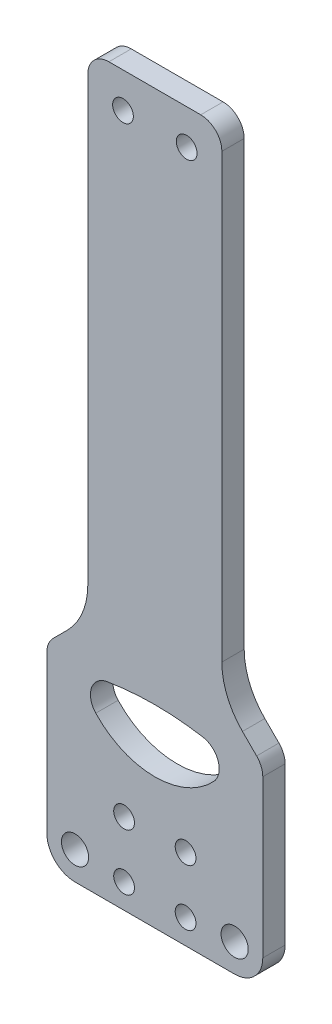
ISO-10303-21;
HEADER;
FILE_DESCRIPTION(('STEP AP214'),'2;1');
FILE_NAME('part.step','',(''),(''),'','','');
FILE_SCHEMA(('AUTOMOTIVE_DESIGN { 1 0 10303 214 1 1 1 1 }'));
ENDSEC;
DATA;
#1=APPLICATION_CONTEXT('core data for automotive mechanical design processes');
#2=APPLICATION_PROTOCOL_DEFINITION('international standard','automotive_design',2000,#1);
#3=PRODUCT_CONTEXT('',#1,'mechanical');
#4=PRODUCT('Part','Part','',(#3));
#5=PRODUCT_RELATED_PRODUCT_CATEGORY('part','',(#4));
#6=PRODUCT_DEFINITION_FORMATION('','',#4);
#7=PRODUCT_DEFINITION_CONTEXT('part definition',#1,'design');
#8=PRODUCT_DEFINITION('design','',#6,#7);
#9=PRODUCT_DEFINITION_SHAPE('','',#8);
#10=(LENGTH_UNIT() NAMED_UNIT(*) SI_UNIT(.MILLI.,.METRE.));
#11=(NAMED_UNIT(*) PLANE_ANGLE_UNIT() SI_UNIT($,.RADIAN.));
#12=(NAMED_UNIT(*) SI_UNIT($,.STERADIAN.) SOLID_ANGLE_UNIT());
#13=UNCERTAINTY_MEASURE_WITH_UNIT(LENGTH_MEASURE(1.E-05),#10,'distance_accuracy_value','');
#14=(GEOMETRIC_REPRESENTATION_CONTEXT(3) GLOBAL_UNCERTAINTY_ASSIGNED_CONTEXT((#13)) GLOBAL_UNIT_ASSIGNED_CONTEXT((#10,
#11,#12)) REPRESENTATION_CONTEXT('',''));
#15=CARTESIAN_POINT('',(0.,0.,0.));
#16=DIRECTION('',(0.,0.,1.));
#17=DIRECTION('',(1.,0.,0.));
#18=AXIS2_PLACEMENT_3D('',#15,#16,#17);
#19=CARTESIAN_POINT('',(0.,0.,3.175));
#20=DIRECTION('',(0.,0.,1.));
#21=DIRECTION('',(1.,0.,0.));
#22=AXIS2_PLACEMENT_3D('',#19,#20,#21);
#23=PLANE('',#22);
#24=CARTESIAN_POINT('',(-4.52500000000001,111.858882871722,3.175));
#25=DIRECTION('',(0.,0.,1.));
#26=DIRECTION('',(1.,0.,0.));
#27=AXIS2_PLACEMENT_3D('',#24,#25,#26);
#28=CIRCLE('',#27,1.4732);
#29=CARTESIAN_POINT('',(-3.0518,111.858882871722,3.175));
#30=VERTEX_POINT('',#29);
#31=EDGE_CURVE('E692',#30,#30,#28,.T.);
#32=ORIENTED_EDGE('',*,*,#31,.F.);
#33=EDGE_LOOP('',(#32));
#34=FACE_BOUND('',#33,.T.);
#35=CARTESIAN_POINT('',(-4.36880000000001,17.,3.175));
#36=DIRECTION('',(0.,0.,1.));
#37=DIRECTION('',(1.,0.,0.));
#38=AXIS2_PLACEMENT_3D('',#35,#36,#37);
#39=CIRCLE('',#38,1.4732);
#40=CARTESIAN_POINT('',(-2.89560000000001,17.,3.175));
#41=VERTEX_POINT('',#40);
#42=EDGE_CURVE('E700',#41,#41,#39,.T.);
#43=ORIENTED_EDGE('',*,*,#42,.F.);
#44=EDGE_LOOP('',(#43));
#45=FACE_BOUND('',#44,.T.);
#46=CARTESIAN_POINT('',(4.36880000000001,25.,3.175));
#47=DIRECTION('',(0.,0.,1.));
#48=DIRECTION('',(1.,0.,0.));
#49=AXIS2_PLACEMENT_3D('',#46,#47,#48);
#50=CIRCLE('',#49,1.4732);
#51=CARTESIAN_POINT('',(5.84200000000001,25.,3.175));
#52=VERTEX_POINT('',#51);
#53=EDGE_CURVE('E708',#52,#52,#50,.T.);
#54=ORIENTED_EDGE('',*,*,#53,.F.);
#55=EDGE_LOOP('',(#54));
#56=FACE_BOUND('',#55,.T.);
#57=CARTESIAN_POINT('',(11.34314575,17.5,3.175));
#58=DIRECTION('',(0.,0.,1.));
#59=DIRECTION('',(-1.,0.,0.));
#60=AXIS2_PLACEMENT_3D('',#57,#58,#59);
#61=CIRCLE('',#60,1.9304);
#62=CARTESIAN_POINT('',(9.41274575,17.5,3.175));
#63=VERTEX_POINT('',#62);
#64=EDGE_CURVE('E211',#63,#63,#61,.T.);
#65=ORIENTED_EDGE('',*,*,#64,.F.);
#66=EDGE_LOOP('',(#65));
#67=FACE_BOUND('',#66,.T.);
#68=DIRECTION('',(0.,-1.,0.));
#69=VECTOR('',#68,1.);
#70=CARTESIAN_POINT('',(-15.34314575,13.5000000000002,3.175));
#71=LINE('',#70,#69);
#72=CARTESIAN_POINT('',(-15.34314575,39.7980964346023,3.175));
#73=VERTEX_POINT('',#72);
#74=CARTESIAN_POINT('',(-15.34314575,17.5000000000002,3.175));
#75=VERTEX_POINT('',#74);
#76=EDGE_CURVE('E238',#73,#75,#71,.T.);
#77=ORIENTED_EDGE('',*,*,#76,.T.);
#78=CARTESIAN_POINT('',(-11.34314575,17.5000000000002,3.175));
#79=DIRECTION('',(0.,0.,1.));
#80=DIRECTION('',(1.,0.,0.));
#81=AXIS2_PLACEMENT_3D('',#78,#79,#80);
#82=CIRCLE('',#81,4.);
#83=CARTESIAN_POINT('',(-11.34314575,13.5000000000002,3.175));
#84=VERTEX_POINT('',#83);
#85=EDGE_CURVE('E45',#75,#84,#82,.T.);
#86=ORIENTED_EDGE('',*,*,#85,.T.);
#87=DIRECTION('',(1.,0.,0.));
#88=VECTOR('',#87,1.);
#89=CARTESIAN_POINT('',(-15.34314575,13.5000000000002,3.175));
#90=LINE('',#89,#88);
#91=CARTESIAN_POINT('',(11.34314575,13.5000000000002,3.175));
#92=VERTEX_POINT('',#91);
#93=EDGE_CURVE('E240',#84,#92,#90,.T.);
#94=ORIENTED_EDGE('',*,*,#93,.T.);
#95=CARTESIAN_POINT('',(11.34314575,17.5000000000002,3.175));
#96=DIRECTION('',(0.,0.,1.));
#97=DIRECTION('',(1.,0.,0.));
#98=AXIS2_PLACEMENT_3D('',#95,#96,#97);
#99=CIRCLE('',#98,4.);
#100=CARTESIAN_POINT('',(15.34314575,17.5000000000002,3.175));
#101=VERTEX_POINT('',#100);
#102=EDGE_CURVE('E52',#92,#101,#99,.T.);
#103=ORIENTED_EDGE('',*,*,#102,.T.);
#104=DIRECTION('',(0.,1.,0.));
#105=VECTOR('',#104,1.);
#106=CARTESIAN_POINT('',(15.34314575,13.5000000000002,3.175));
#107=LINE('',#106,#105);
#108=CARTESIAN_POINT('',(15.34314575,39.7980964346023,3.175));
#109=VERTEX_POINT('',#108);
#110=EDGE_CURVE('E222',#101,#109,#107,.T.);
#111=ORIENTED_EDGE('',*,*,#110,.T.);
#112=CARTESIAN_POINT('',(12.34314575,39.7980964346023,3.175));
#113=DIRECTION('',(0.,0.,1.));
#114=DIRECTION('',(1.,0.,0.));
#115=AXIS2_PLACEMENT_3D('',#112,#113,#114);
#116=CIRCLE('',#115,3.);
#117=CARTESIAN_POINT('',(14.4644660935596,41.919416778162,3.175));
#118=VERTEX_POINT('',#117);
#119=EDGE_CURVE('E281',#109,#118,#116,.T.);
#120=ORIENTED_EDGE('',*,*,#119,.T.);
#121=DIRECTION('',(-0.707106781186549,0.707106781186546,0.));
#122=VECTOR('',#121,1.);
#123=CARTESIAN_POINT('',(15.34314575,41.0407371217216,3.175));
#124=LINE('',#123,#122);
#125=CARTESIAN_POINT('',(12.4539321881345,43.929950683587,3.175));
#126=VERTEX_POINT('',#125);
#127=EDGE_CURVE('E224',#118,#126,#124,.T.);
#128=ORIENTED_EDGE('',*,*,#127,.T.);
#129=CARTESIAN_POINT('',(19.525,51.0010184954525,3.175));
#130=DIRECTION('',(0.,0.,1.));
#131=DIRECTION('',(1.,0.,0.));
#132=AXIS2_PLACEMENT_3D('',#129,#130,#131);
#133=CIRCLE('',#132,10.);
#134=CARTESIAN_POINT('',(9.525,51.0010184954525,3.175));
#135=VERTEX_POINT('',#134);
#136=EDGE_CURVE('E314',#126,#135,#133,.F.);
#137=ORIENTED_EDGE('',*,*,#136,.T.);
#138=DIRECTION('',(0.,1.,0.));
#139=VECTOR('',#138,1.);
#140=CARTESIAN_POINT('',(9.525,46.8588828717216,3.175));
#141=LINE('',#140,#139);
#142=CARTESIAN_POINT('',(9.525,113.858882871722,3.175));
#143=VERTEX_POINT('',#142);
#144=EDGE_CURVE('E228',#135,#143,#141,.T.);
#145=ORIENTED_EDGE('',*,*,#144,.T.);
#146=CARTESIAN_POINT('',(6.525,113.858882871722,3.175));
#147=DIRECTION('',(0.,0.,1.));
#148=DIRECTION('',(1.,0.,0.));
#149=AXIS2_PLACEMENT_3D('',#146,#147,#148);
#150=CIRCLE('',#149,3.);
#151=CARTESIAN_POINT('',(6.525,116.858882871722,3.175));
#152=VERTEX_POINT('',#151);
#153=EDGE_CURVE('E277',#143,#152,#150,.T.);
#154=ORIENTED_EDGE('',*,*,#153,.T.);
#155=DIRECTION('',(-1.,0.,0.));
#156=VECTOR('',#155,1.);
#157=CARTESIAN_POINT('',(9.525,116.858882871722,3.175));
#158=LINE('',#157,#156);
#159=CARTESIAN_POINT('',(-6.52500000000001,116.858882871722,3.175));
#160=VERTEX_POINT('',#159);
#161=EDGE_CURVE('E230',#152,#160,#158,.T.);
#162=ORIENTED_EDGE('',*,*,#161,.T.);
#163=CARTESIAN_POINT('',(-6.52500000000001,113.858882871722,3.175));
#164=DIRECTION('',(0.,0.,1.));
#165=DIRECTION('',(1.,0.,0.));
#166=AXIS2_PLACEMENT_3D('',#163,#164,#165);
#167=CIRCLE('',#166,3.);
#168=CARTESIAN_POINT('',(-9.52500000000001,113.858882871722,3.175));
#169=VERTEX_POINT('',#168);
#170=EDGE_CURVE('E279',#160,#169,#167,.T.);
#171=ORIENTED_EDGE('',*,*,#170,.T.);
#172=DIRECTION('',(0.,-1.,0.));
#173=VECTOR('',#172,1.);
#174=CARTESIAN_POINT('',(-9.525,46.8588828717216,3.175));
#175=LINE('',#174,#173);
#176=CARTESIAN_POINT('',(-9.525,51.0010184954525,3.175));
#177=VERTEX_POINT('',#176);
#178=EDGE_CURVE('E233',#169,#177,#175,.T.);
#179=ORIENTED_EDGE('',*,*,#178,.T.);
#180=CARTESIAN_POINT('',(-19.525,51.0010184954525,3.175));
#181=DIRECTION('',(0.,0.,1.));
#182=DIRECTION('',(1.,0.,0.));
#183=AXIS2_PLACEMENT_3D('',#180,#181,#182);
#184=CIRCLE('',#183,10.);
#185=CARTESIAN_POINT('',(-12.4539321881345,43.929950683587,3.175));
#186=VERTEX_POINT('',#185);
#187=EDGE_CURVE('E318',#177,#186,#184,.F.);
#188=ORIENTED_EDGE('',*,*,#187,.T.);
#189=DIRECTION('',(-0.707106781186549,-0.707106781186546,0.));
#190=VECTOR('',#189,1.);
#191=CARTESIAN_POINT('',(-15.34314575,41.0407371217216,3.175));
#192=LINE('',#191,#190);
#193=CARTESIAN_POINT('',(-14.4644660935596,41.919416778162,3.175));
#194=VERTEX_POINT('',#193);
#195=EDGE_CURVE('E236',#186,#194,#192,.T.);
#196=ORIENTED_EDGE('',*,*,#195,.T.);
#197=CARTESIAN_POINT('',(-12.34314575,39.7980964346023,3.175));
#198=DIRECTION('',(0.,0.,1.));
#199=DIRECTION('',(1.,0.,0.));
#200=AXIS2_PLACEMENT_3D('',#197,#198,#199);
#201=CIRCLE('',#200,3.);
#202=EDGE_CURVE('E283',#194,#73,#201,.T.);
#203=ORIENTED_EDGE('',*,*,#202,.T.);
#204=EDGE_LOOP('',(#77,#86,#94,#103,#111,#120,#128,#137,#145,#154,#162,#171,#179,#188,#196,#203));
#205=FACE_BOUND('',#204,.T.);
#206=CARTESIAN_POINT('',(6.35000000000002,37.668521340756,3.175));
#207=DIRECTION('',(0.,0.,1.));
#208=DIRECTION('',(1.,0.,0.));
#209=AXIS2_PLACEMENT_3D('',#206,#207,#208);
#210=CIRCLE('',#209,2.80000000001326);
#211=CARTESIAN_POINT('',(8.39274834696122,35.7535333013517,3.175));
#212=VERTEX_POINT('',#211);
#213=CARTESIAN_POINT('',(6.81544502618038,40.4295647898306,3.175));
#214=VERTEX_POINT('',#213);
#215=EDGE_CURVE('E188',#212,#214,#210,.T.);
#216=ORIENTED_EDGE('',*,*,#215,.F.);
#217=CARTESIAN_POINT('',(0.,43.6213711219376,3.175));
#218=DIRECTION('',(0.,0.,1.));
#219=DIRECTION('',(-1.,0.,0.));
#220=AXIS2_PLACEMENT_3D('',#217,#218,#219);
#221=CIRCLE('',#220,11.503960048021);
#222=CARTESIAN_POINT('',(-8.39274834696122,35.7535333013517,3.175));
#223=VERTEX_POINT('',#222);
#224=EDGE_CURVE('E178',#223,#212,#221,.T.);
#225=ORIENTED_EDGE('',*,*,#224,.F.);
#226=CARTESIAN_POINT('',(-6.35,37.668521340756,3.175));
#227=DIRECTION('',(0.,0.,1.));
#228=DIRECTION('',(-1.,0.,0.));
#229=AXIS2_PLACEMENT_3D('',#226,#227,#228);
#230=CIRCLE('',#229,2.80000000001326);
#231=CARTESIAN_POINT('',(-6.81544502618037,40.4295647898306,3.175));
#232=VERTEX_POINT('',#231);
#233=EDGE_CURVE('E204',#232,#223,#230,.T.);
#234=ORIENTED_EDGE('',*,*,#233,.F.);
#235=CARTESIAN_POINT('',(0.,1.71222628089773E-13,3.175));
#236=DIRECTION('',(0.,0.,1.));
#237=DIRECTION('',(-1.,0.,0.));
#238=AXIS2_PLACEMENT_3D('',#235,#236,#237);
#239=CIRCLE('',#238,40.9999999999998);
#240=EDGE_CURVE('E202',#214,#232,#239,.T.);
#241=ORIENTED_EDGE('',*,*,#240,.F.);
#242=EDGE_LOOP('',(#216,#225,#234,#241));
#243=FACE_BOUND('',#242,.T.);
#244=CARTESIAN_POINT('',(4.36880000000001,17.,3.175));
#245=DIRECTION('',(0.,0.,1.));
#246=DIRECTION('',(1.,0.,0.));
#247=AXIS2_PLACEMENT_3D('',#244,#245,#246);
#248=CIRCLE('',#247,1.4732);
#249=CARTESIAN_POINT('',(5.84200000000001,17.,3.175));
#250=VERTEX_POINT('',#249);
#251=EDGE_CURVE('E712',#250,#250,#248,.T.);
#252=ORIENTED_EDGE('',*,*,#251,.F.);
#253=EDGE_LOOP('',(#252));
#254=FACE_BOUND('',#253,.T.);
#255=CARTESIAN_POINT('',(-4.36880000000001,25.,3.175));
#256=DIRECTION('',(0.,0.,1.));
#257=DIRECTION('',(1.,0.,0.));
#258=AXIS2_PLACEMENT_3D('',#255,#256,#257);
#259=CIRCLE('',#258,1.4732);
#260=CARTESIAN_POINT('',(-2.89560000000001,25.,3.175));
#261=VERTEX_POINT('',#260);
#262=EDGE_CURVE('E704',#261,#261,#259,.T.);
#263=ORIENTED_EDGE('',*,*,#262,.F.);
#264=EDGE_LOOP('',(#263));
#265=FACE_BOUND('',#264,.T.);
#266=CARTESIAN_POINT('',(-11.34314575,17.5,3.175));
#267=DIRECTION('',(0.,0.,1.));
#268=DIRECTION('',(1.,0.,0.));
#269=AXIS2_PLACEMENT_3D('',#266,#267,#268);
#270=CIRCLE('',#269,1.9304);
#271=CARTESIAN_POINT('',(-9.41274574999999,17.5,3.175));
#272=VERTEX_POINT('',#271);
#273=EDGE_CURVE('E696',#272,#272,#270,.T.);
#274=ORIENTED_EDGE('',*,*,#273,.F.);
#275=EDGE_LOOP('',(#274));
#276=FACE_BOUND('',#275,.T.);
#277=CARTESIAN_POINT('',(4.52499999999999,111.858882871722,3.175));
#278=DIRECTION('',(0.,0.,1.));
#279=DIRECTION('',(-1.,0.,0.));
#280=AXIS2_PLACEMENT_3D('',#277,#278,#279);
#281=CIRCLE('',#280,1.4732);
#282=CARTESIAN_POINT('',(3.05179999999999,111.858882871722,3.175));
#283=VERTEX_POINT('',#282);
#284=EDGE_CURVE('E687',#283,#283,#281,.T.);
#285=ORIENTED_EDGE('',*,*,#284,.F.);
#286=EDGE_LOOP('',(#285));
#287=FACE_BOUND('',#286,.T.);
#288=ADVANCED_FACE('F37',(#34,#45,#56,#67,#205,#243,#254,#265,#276,#287),#23,.T.);
#289=CARTESIAN_POINT('',(0.,0.,0.));
#290=DIRECTION('',(0.,0.,1.));
#291=DIRECTION('',(1.,0.,0.));
#292=AXIS2_PLACEMENT_3D('',#289,#290,#291);
#293=PLANE('',#292);
#294=DIRECTION('',(1.,0.,0.));
#295=VECTOR('',#294,1.);
#296=CARTESIAN_POINT('',(-15.34314575,13.5000000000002,0.));
#297=LINE('',#296,#295);
#298=CARTESIAN_POINT('',(-11.34314575,13.5000000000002,0.));
#299=VERTEX_POINT('',#298);
#300=CARTESIAN_POINT('',(11.34314575,13.5000000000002,0.));
#301=VERTEX_POINT('',#300);
#302=EDGE_CURVE('E225',#299,#301,#297,.T.);
#303=ORIENTED_EDGE('',*,*,#302,.F.);
#304=CARTESIAN_POINT('',(-11.34314575,17.5000000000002,0.));
#305=DIRECTION('',(0.,0.,1.));
#306=DIRECTION('',(1.,0.,0.));
#307=AXIS2_PLACEMENT_3D('',#304,#305,#306);
#308=CIRCLE('',#307,4.);
#309=CARTESIAN_POINT('',(-15.34314575,17.5000000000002,0.));
#310=VERTEX_POINT('',#309);
#311=EDGE_CURVE('E327',#299,#310,#308,.F.);
#312=ORIENTED_EDGE('',*,*,#311,.T.);
#313=DIRECTION('',(0.,-1.,0.));
#314=VECTOR('',#313,1.);
#315=CARTESIAN_POINT('',(-15.34314575,13.5000000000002,0.));
#316=LINE('',#315,#314);
#317=CARTESIAN_POINT('',(-15.34314575,39.7980964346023,0.));
#318=VERTEX_POINT('',#317);
#319=EDGE_CURVE('E257',#318,#310,#316,.T.);
#320=ORIENTED_EDGE('',*,*,#319,.F.);
#321=CARTESIAN_POINT('',(-12.34314575,39.7980964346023,0.));
#322=DIRECTION('',(0.,0.,1.));
#323=DIRECTION('',(1.,0.,0.));
#324=AXIS2_PLACEMENT_3D('',#321,#322,#323);
#325=CIRCLE('',#324,3.);
#326=CARTESIAN_POINT('',(-14.4644660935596,41.919416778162,0.));
#327=VERTEX_POINT('',#326);
#328=EDGE_CURVE('E271',#318,#327,#325,.F.);
#329=ORIENTED_EDGE('',*,*,#328,.T.);
#330=DIRECTION('',(-0.707106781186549,-0.707106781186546,0.));
#331=VECTOR('',#330,1.);
#332=CARTESIAN_POINT('',(-15.34314575,41.0407371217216,0.));
#333=LINE('',#332,#331);
#334=CARTESIAN_POINT('',(-12.4539321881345,43.929950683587,0.));
#335=VERTEX_POINT('',#334);
#336=EDGE_CURVE('E255',#335,#327,#333,.T.);
#337=ORIENTED_EDGE('',*,*,#336,.F.);
#338=CARTESIAN_POINT('',(-19.525,51.0010184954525,0.));
#339=DIRECTION('',(0.,0.,1.));
#340=DIRECTION('',(1.,0.,0.));
#341=AXIS2_PLACEMENT_3D('',#338,#339,#340);
#342=CIRCLE('',#341,10.);
#343=CARTESIAN_POINT('',(-9.525,51.0010184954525,0.));
#344=VERTEX_POINT('',#343);
#345=EDGE_CURVE('E316',#335,#344,#342,.T.);
#346=ORIENTED_EDGE('',*,*,#345,.T.);
#347=DIRECTION('',(0.,-1.,0.));
#348=VECTOR('',#347,1.);
#349=CARTESIAN_POINT('',(-9.525,46.8588828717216,0.));
#350=LINE('',#349,#348);
#351=CARTESIAN_POINT('',(-9.52500000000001,113.858882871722,0.));
#352=VERTEX_POINT('',#351);
#353=EDGE_CURVE('E252',#352,#344,#350,.T.);
#354=ORIENTED_EDGE('',*,*,#353,.F.);
#355=CARTESIAN_POINT('',(-6.52500000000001,113.858882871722,0.));
#356=DIRECTION('',(0.,0.,1.));
#357=DIRECTION('',(1.,0.,0.));
#358=AXIS2_PLACEMENT_3D('',#355,#356,#357);
#359=CIRCLE('',#358,3.);
#360=CARTESIAN_POINT('',(-6.52500000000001,116.858882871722,0.));
#361=VERTEX_POINT('',#360);
#362=EDGE_CURVE('E266',#352,#361,#359,.F.);
#363=ORIENTED_EDGE('',*,*,#362,.T.);
#364=DIRECTION('',(-1.,0.,0.));
#365=VECTOR('',#364,1.);
#366=CARTESIAN_POINT('',(9.525,116.858882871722,0.));
#367=LINE('',#366,#365);
#368=CARTESIAN_POINT('',(6.525,116.858882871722,0.));
#369=VERTEX_POINT('',#368);
#370=EDGE_CURVE('E249',#369,#361,#367,.T.);
#371=ORIENTED_EDGE('',*,*,#370,.F.);
#372=CARTESIAN_POINT('',(6.525,113.858882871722,0.));
#373=DIRECTION('',(0.,0.,1.));
#374=DIRECTION('',(1.,0.,0.));
#375=AXIS2_PLACEMENT_3D('',#372,#373,#374);
#376=CIRCLE('',#375,3.);
#377=CARTESIAN_POINT('',(9.525,113.858882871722,0.));
#378=VERTEX_POINT('',#377);
#379=EDGE_CURVE('E263',#369,#378,#376,.F.);
#380=ORIENTED_EDGE('',*,*,#379,.T.);
#381=DIRECTION('',(0.,1.,0.));
#382=VECTOR('',#381,1.);
#383=CARTESIAN_POINT('',(9.525,46.8588828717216,0.));
#384=LINE('',#383,#382);
#385=CARTESIAN_POINT('',(9.525,51.0010184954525,0.));
#386=VERTEX_POINT('',#385);
#387=EDGE_CURVE('E247',#386,#378,#384,.T.);
#388=ORIENTED_EDGE('',*,*,#387,.F.);
#389=CARTESIAN_POINT('',(19.525,51.0010184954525,0.));
#390=DIRECTION('',(0.,0.,1.));
#391=DIRECTION('',(1.,0.,0.));
#392=AXIS2_PLACEMENT_3D('',#389,#390,#391);
#393=CIRCLE('',#392,10.);
#394=CARTESIAN_POINT('',(12.4539321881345,43.929950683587,0.));
#395=VERTEX_POINT('',#394);
#396=EDGE_CURVE('E312',#386,#395,#393,.T.);
#397=ORIENTED_EDGE('',*,*,#396,.T.);
#398=DIRECTION('',(-0.707106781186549,0.707106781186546,0.));
#399=VECTOR('',#398,1.);
#400=CARTESIAN_POINT('',(15.34314575,41.0407371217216,0.));
#401=LINE('',#400,#399);
#402=CARTESIAN_POINT('',(14.4644660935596,41.919416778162,0.));
#403=VERTEX_POINT('',#402);
#404=EDGE_CURVE('E244',#403,#395,#401,.T.);
#405=ORIENTED_EDGE('',*,*,#404,.F.);
#406=CARTESIAN_POINT('',(12.34314575,39.7980964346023,0.));
#407=DIRECTION('',(0.,0.,1.));
#408=DIRECTION('',(1.,0.,0.));
#409=AXIS2_PLACEMENT_3D('',#406,#407,#408);
#410=CIRCLE('',#409,3.);
#411=CARTESIAN_POINT('',(15.34314575,39.7980964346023,0.));
#412=VERTEX_POINT('',#411);
#413=EDGE_CURVE('E268',#403,#412,#410,.F.);
#414=ORIENTED_EDGE('',*,*,#413,.T.);
#415=DIRECTION('',(0.,1.,0.));
#416=VECTOR('',#415,1.);
#417=CARTESIAN_POINT('',(15.34314575,13.5000000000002,0.));
#418=LINE('',#417,#416);
#419=CARTESIAN_POINT('',(15.34314575,17.5000000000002,0.));
#420=VERTEX_POINT('',#419);
#421=EDGE_CURVE('E196',#420,#412,#418,.T.);
#422=ORIENTED_EDGE('',*,*,#421,.F.);
#423=CARTESIAN_POINT('',(11.34314575,17.5000000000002,0.));
#424=DIRECTION('',(0.,0.,1.));
#425=DIRECTION('',(1.,0.,0.));
#426=AXIS2_PLACEMENT_3D('',#423,#424,#425);
#427=CIRCLE('',#426,4.);
#428=EDGE_CURVE('E325',#420,#301,#427,.F.);
#429=ORIENTED_EDGE('',*,*,#428,.T.);
#430=EDGE_LOOP('',(#303,#312,#320,#329,#337,#346,#354,#363,#371,#380,#388,#397,#405,#414,#422,#429));
#431=FACE_BOUND('',#430,.T.);
#432=CARTESIAN_POINT('',(0.,43.6213711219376,0.));
#433=DIRECTION('',(0.,0.,1.));
#434=DIRECTION('',(-1.,0.,0.));
#435=AXIS2_PLACEMENT_3D('',#432,#433,#434);
#436=CIRCLE('',#435,11.503960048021);
#437=CARTESIAN_POINT('',(-8.39274834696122,35.7535333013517,0.));
#438=VERTEX_POINT('',#437);
#439=CARTESIAN_POINT('',(8.39274834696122,35.7535333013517,0.));
#440=VERTEX_POINT('',#439);
#441=EDGE_CURVE('E209',#438,#440,#436,.T.);
#442=ORIENTED_EDGE('',*,*,#441,.T.);
#443=CARTESIAN_POINT('',(6.35000000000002,37.668521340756,0.));
#444=DIRECTION('',(0.,0.,1.));
#445=DIRECTION('',(1.,0.,0.));
#446=AXIS2_PLACEMENT_3D('',#443,#444,#445);
#447=CIRCLE('',#446,2.80000000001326);
#448=CARTESIAN_POINT('',(6.81544502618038,40.4295647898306,0.));
#449=VERTEX_POINT('',#448);
#450=EDGE_CURVE('E195',#440,#449,#447,.T.);
#451=ORIENTED_EDGE('',*,*,#450,.T.);
#452=CARTESIAN_POINT('',(0.,1.71222628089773E-13,0.));
#453=DIRECTION('',(0.,0.,1.));
#454=DIRECTION('',(-1.,0.,0.));
#455=AXIS2_PLACEMENT_3D('',#452,#453,#454);
#456=CIRCLE('',#455,40.9999999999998);
#457=CARTESIAN_POINT('',(-6.81544502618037,40.4295647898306,0.));
#458=VERTEX_POINT('',#457);
#459=EDGE_CURVE('E213',#449,#458,#456,.T.);
#460=ORIENTED_EDGE('',*,*,#459,.T.);
#461=CARTESIAN_POINT('',(-6.35,37.668521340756,0.));
#462=DIRECTION('',(0.,0.,1.));
#463=DIRECTION('',(-1.,0.,0.));
#464=AXIS2_PLACEMENT_3D('',#461,#462,#463);
#465=CIRCLE('',#464,2.80000000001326);
#466=EDGE_CURVE('E189',#458,#438,#465,.T.);
#467=ORIENTED_EDGE('',*,*,#466,.T.);
#468=EDGE_LOOP('',(#442,#451,#460,#467));
#469=FACE_BOUND('',#468,.T.);
#470=CARTESIAN_POINT('',(11.34314575,17.5,0.));
#471=DIRECTION('',(0.,0.,1.));
#472=DIRECTION('',(-1.,0.,0.));
#473=AXIS2_PLACEMENT_3D('',#470,#471,#472);
#474=CIRCLE('',#473,1.9304);
#475=CARTESIAN_POINT('',(9.41274575,17.5,0.));
#476=VERTEX_POINT('',#475);
#477=EDGE_CURVE('E658',#476,#476,#474,.T.);
#478=ORIENTED_EDGE('',*,*,#477,.T.);
#479=EDGE_LOOP('',(#478));
#480=FACE_BOUND('',#479,.T.);
#481=CARTESIAN_POINT('',(4.36880000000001,17.,0.));
#482=DIRECTION('',(0.,0.,1.));
#483=DIRECTION('',(1.,0.,0.));
#484=AXIS2_PLACEMENT_3D('',#481,#482,#483);
#485=CIRCLE('',#484,1.4732);
#486=CARTESIAN_POINT('',(5.84200000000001,17.,0.));
#487=VERTEX_POINT('',#486);
#488=EDGE_CURVE('E662',#487,#487,#485,.T.);
#489=ORIENTED_EDGE('',*,*,#488,.T.);
#490=EDGE_LOOP('',(#489));
#491=FACE_BOUND('',#490,.T.);
#492=CARTESIAN_POINT('',(4.36880000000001,25.,0.));
#493=DIRECTION('',(0.,0.,1.));
#494=DIRECTION('',(1.,0.,0.));
#495=AXIS2_PLACEMENT_3D('',#492,#493,#494);
#496=CIRCLE('',#495,1.4732);
#497=CARTESIAN_POINT('',(5.84200000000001,25.,0.));
#498=VERTEX_POINT('',#497);
#499=EDGE_CURVE('E666',#498,#498,#496,.T.);
#500=ORIENTED_EDGE('',*,*,#499,.T.);
#501=EDGE_LOOP('',(#500));
#502=FACE_BOUND('',#501,.T.);
#503=CARTESIAN_POINT('',(-4.36880000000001,25.,0.));
#504=DIRECTION('',(0.,0.,1.));
#505=DIRECTION('',(1.,0.,0.));
#506=AXIS2_PLACEMENT_3D('',#503,#504,#505);
#507=CIRCLE('',#506,1.4732);
#508=CARTESIAN_POINT('',(-2.89560000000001,25.,0.));
#509=VERTEX_POINT('',#508);
#510=EDGE_CURVE('E670',#509,#509,#507,.T.);
#511=ORIENTED_EDGE('',*,*,#510,.T.);
#512=EDGE_LOOP('',(#511));
#513=FACE_BOUND('',#512,.T.);
#514=CARTESIAN_POINT('',(-4.36880000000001,17.,0.));
#515=DIRECTION('',(0.,0.,1.));
#516=DIRECTION('',(1.,0.,0.));
#517=AXIS2_PLACEMENT_3D('',#514,#515,#516);
#518=CIRCLE('',#517,1.4732);
#519=CARTESIAN_POINT('',(-2.89560000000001,17.,0.));
#520=VERTEX_POINT('',#519);
#521=EDGE_CURVE('E674',#520,#520,#518,.T.);
#522=ORIENTED_EDGE('',*,*,#521,.T.);
#523=EDGE_LOOP('',(#522));
#524=FACE_BOUND('',#523,.T.);
#525=CARTESIAN_POINT('',(-11.34314575,17.5,0.));
#526=DIRECTION('',(0.,0.,1.));
#527=DIRECTION('',(1.,0.,0.));
#528=AXIS2_PLACEMENT_3D('',#525,#526,#527);
#529=CIRCLE('',#528,1.9304);
#530=CARTESIAN_POINT('',(-9.41274574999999,17.5,0.));
#531=VERTEX_POINT('',#530);
#532=EDGE_CURVE('E678',#531,#531,#529,.T.);
#533=ORIENTED_EDGE('',*,*,#532,.T.);
#534=EDGE_LOOP('',(#533));
#535=FACE_BOUND('',#534,.T.);
#536=CARTESIAN_POINT('',(-4.52500000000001,111.858882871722,0.));
#537=DIRECTION('',(0.,0.,1.));
#538=DIRECTION('',(1.,0.,0.));
#539=AXIS2_PLACEMENT_3D('',#536,#537,#538);
#540=CIRCLE('',#539,1.4732);
#541=CARTESIAN_POINT('',(-3.0518,111.858882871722,0.));
#542=VERTEX_POINT('',#541);
#543=EDGE_CURVE('E682',#542,#542,#540,.T.);
#544=ORIENTED_EDGE('',*,*,#543,.T.);
#545=EDGE_LOOP('',(#544));
#546=FACE_BOUND('',#545,.T.);
#547=CARTESIAN_POINT('',(4.52499999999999,111.858882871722,0.));
#548=DIRECTION('',(0.,0.,1.));
#549=DIRECTION('',(-1.,0.,0.));
#550=AXIS2_PLACEMENT_3D('',#547,#548,#549);
#551=CIRCLE('',#550,1.4732);
#552=CARTESIAN_POINT('',(3.05179999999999,111.858882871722,0.));
#553=VERTEX_POINT('',#552);
#554=EDGE_CURVE('E685',#553,#553,#551,.T.);
#555=ORIENTED_EDGE('',*,*,#554,.T.);
#556=EDGE_LOOP('',(#555));
#557=FACE_BOUND('',#556,.T.);
#558=ADVANCED_FACE('F341',(#431,#469,#480,#491,#502,#513,#524,#535,#546,#557),#293,.F.);
#559=CARTESIAN_POINT('',(15.34314575,13.5000000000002,3.175));
#560=DIRECTION('',(-1.,0.,0.));
#561=DIRECTION('',(0.,-1.,0.));
#562=AXIS2_PLACEMENT_3D('',#559,#560,#561);
#563=PLANE('',#562);
#564=ORIENTED_EDGE('',*,*,#110,.F.);
#565=DIRECTION('',(0.,0.,-1.));
#566=VECTOR('',#565,1.);
#567=CARTESIAN_POINT('',(15.34314575,17.5000000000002,3.175));
#568=LINE('',#567,#566);
#569=EDGE_CURVE('E11',#101,#420,#568,.T.);
#570=ORIENTED_EDGE('',*,*,#569,.T.);
#571=ORIENTED_EDGE('',*,*,#421,.T.);
#572=DIRECTION('',(0.,0.,-1.));
#573=VECTOR('',#572,1.);
#574=CARTESIAN_POINT('',(15.34314575,39.7980964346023,3.175));
#575=LINE('',#574,#573);
#576=EDGE_CURVE('E288',#412,#109,#575,.F.);
#577=ORIENTED_EDGE('',*,*,#576,.T.);
#578=EDGE_LOOP('',(#564,#570,#571,#577));
#579=FACE_BOUND('',#578,.T.);
#580=ADVANCED_FACE('F396',(#579),#563,.F.);
#581=CARTESIAN_POINT('',(15.34314575,41.0407371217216,3.175));
#582=DIRECTION('',(-0.707106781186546,-0.707106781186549,0.));
#583=DIRECTION('',(0.707106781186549,-0.707106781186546,0.));
#584=AXIS2_PLACEMENT_3D('',#581,#582,#583);
#585=PLANE('',#584);
#586=ORIENTED_EDGE('',*,*,#404,.T.);
#587=DIRECTION('',(0.,0.,-1.));
#588=VECTOR('',#587,1.);
#589=CARTESIAN_POINT('',(12.4539321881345,43.929950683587,3.175));
#590=LINE('',#589,#588);
#591=EDGE_CURVE('E305',#395,#126,#590,.F.);
#592=ORIENTED_EDGE('',*,*,#591,.T.);
#593=ORIENTED_EDGE('',*,*,#127,.F.);
#594=DIRECTION('',(0.,0.,-1.));
#595=VECTOR('',#594,1.);
#596=CARTESIAN_POINT('',(14.4644660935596,41.919416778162,3.175));
#597=LINE('',#596,#595);
#598=EDGE_CURVE('E285',#118,#403,#597,.T.);
#599=ORIENTED_EDGE('',*,*,#598,.T.);
#600=EDGE_LOOP('',(#586,#592,#593,#599));
#601=FACE_BOUND('',#600,.T.);
#602=ADVANCED_FACE('F388',(#601),#585,.F.);
#603=CARTESIAN_POINT('',(9.525,46.8588828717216,3.175));
#604=DIRECTION('',(-1.,0.,0.));
#605=DIRECTION('',(0.,-1.,0.));
#606=AXIS2_PLACEMENT_3D('',#603,#604,#605);
#607=PLANE('',#606);
#608=ORIENTED_EDGE('',*,*,#144,.F.);
#609=DIRECTION('',(0.,0.,-1.));
#610=VECTOR('',#609,1.);
#611=CARTESIAN_POINT('',(9.525,51.0010184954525,0.));
#612=LINE('',#611,#610);
#613=EDGE_CURVE('E302',#135,#386,#612,.T.);
#614=ORIENTED_EDGE('',*,*,#613,.T.);
#615=ORIENTED_EDGE('',*,*,#387,.T.);
#616=DIRECTION('',(0.,0.,-1.));
#617=VECTOR('',#616,1.);
#618=CARTESIAN_POINT('',(9.525,113.858882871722,3.175));
#619=LINE('',#618,#617);
#620=EDGE_CURVE('E299',#378,#143,#619,.F.);
#621=ORIENTED_EDGE('',*,*,#620,.T.);
#622=EDGE_LOOP('',(#608,#614,#615,#621));
#623=FACE_BOUND('',#622,.T.);
#624=ADVANCED_FACE('F380',(#623),#607,.F.);
#625=CARTESIAN_POINT('',(9.525,116.858882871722,3.175));
#626=DIRECTION('',(0.,-1.,0.));
#627=DIRECTION('',(0.,0.,-1.));
#628=AXIS2_PLACEMENT_3D('',#625,#626,#627);
#629=PLANE('',#628);
#630=ORIENTED_EDGE('',*,*,#370,.T.);
#631=DIRECTION('',(0.,0.,-1.));
#632=VECTOR('',#631,1.);
#633=CARTESIAN_POINT('',(-6.52500000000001,116.858882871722,3.175));
#634=LINE('',#633,#632);
#635=EDGE_CURVE('E297',#361,#160,#634,.F.);
#636=ORIENTED_EDGE('',*,*,#635,.T.);
#637=ORIENTED_EDGE('',*,*,#161,.F.);
#638=DIRECTION('',(0.,0.,-1.));
#639=VECTOR('',#638,1.);
#640=CARTESIAN_POINT('',(6.525,116.858882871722,3.175));
#641=LINE('',#640,#639);
#642=EDGE_CURVE('E294',#152,#369,#641,.T.);
#643=ORIENTED_EDGE('',*,*,#642,.T.);
#644=EDGE_LOOP('',(#630,#636,#637,#643));
#645=FACE_BOUND('',#644,.T.);
#646=ADVANCED_FACE('F370',(#645),#629,.F.);
#647=CARTESIAN_POINT('',(-9.525,46.8588828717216,3.175));
#648=DIRECTION('',(1.,0.,0.));
#649=DIRECTION('',(0.,1.,0.));
#650=AXIS2_PLACEMENT_3D('',#647,#648,#649);
#651=PLANE('',#650);
#652=ORIENTED_EDGE('',*,*,#353,.T.);
#653=DIRECTION('',(0.,0.,-1.));
#654=VECTOR('',#653,1.);
#655=CARTESIAN_POINT('',(-9.525,51.0010184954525,3.175));
#656=LINE('',#655,#654);
#657=EDGE_CURVE('E310',#344,#177,#656,.F.);
#658=ORIENTED_EDGE('',*,*,#657,.T.);
#659=ORIENTED_EDGE('',*,*,#178,.F.);
#660=DIRECTION('',(0.,0.,-1.));
#661=VECTOR('',#660,1.);
#662=CARTESIAN_POINT('',(-9.52500000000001,113.858882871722,3.175));
#663=LINE('',#662,#661);
#664=EDGE_CURVE('E291',#169,#352,#663,.T.);
#665=ORIENTED_EDGE('',*,*,#664,.T.);
#666=EDGE_LOOP('',(#652,#658,#659,#665));
#667=FACE_BOUND('',#666,.T.);
#668=ADVANCED_FACE('F361',(#667),#651,.F.);
#669=CARTESIAN_POINT('',(-15.34314575,41.0407371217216,3.175));
#670=DIRECTION('',(0.707106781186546,-0.707106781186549,0.));
#671=DIRECTION('',(0.707106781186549,0.707106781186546,0.));
#672=AXIS2_PLACEMENT_3D('',#669,#670,#671);
#673=PLANE('',#672);
#674=ORIENTED_EDGE('',*,*,#195,.F.);
#675=DIRECTION('',(0.,0.,-1.));
#676=VECTOR('',#675,1.);
#677=CARTESIAN_POINT('',(-12.4539321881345,43.929950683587,0.));
#678=LINE('',#677,#676);
#679=EDGE_CURVE('E307',#186,#335,#678,.T.);
#680=ORIENTED_EDGE('',*,*,#679,.T.);
#681=ORIENTED_EDGE('',*,*,#336,.T.);
#682=DIRECTION('',(0.,0.,-1.));
#683=VECTOR('',#682,1.);
#684=CARTESIAN_POINT('',(-14.4644660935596,41.919416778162,3.175));
#685=LINE('',#684,#683);
#686=EDGE_CURVE('E274',#327,#194,#685,.F.);
#687=ORIENTED_EDGE('',*,*,#686,.T.);
#688=EDGE_LOOP('',(#674,#680,#681,#687));
#689=FACE_BOUND('',#688,.T.);
#690=ADVANCED_FACE('F353',(#689),#673,.F.);
#691=CARTESIAN_POINT('',(-15.34314575,13.5000000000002,3.175));
#692=DIRECTION('',(1.,0.,0.));
#693=DIRECTION('',(0.,1.,0.));
#694=AXIS2_PLACEMENT_3D('',#691,#692,#693);
#695=PLANE('',#694);
#696=ORIENTED_EDGE('',*,*,#319,.T.);
#697=DIRECTION('',(0.,0.,-1.));
#698=VECTOR('',#697,1.);
#699=CARTESIAN_POINT('',(-15.34314575,17.5000000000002,3.175));
#700=LINE('',#699,#698);
#701=EDGE_CURVE('E60',#310,#75,#700,.F.);
#702=ORIENTED_EDGE('',*,*,#701,.T.);
#703=ORIENTED_EDGE('',*,*,#76,.F.);
#704=DIRECTION('',(0.,0.,-1.));
#705=VECTOR('',#704,1.);
#706=CARTESIAN_POINT('',(-15.34314575,39.7980964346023,3.175));
#707=LINE('',#706,#705);
#708=EDGE_CURVE('E242',#73,#318,#707,.T.);
#709=ORIENTED_EDGE('',*,*,#708,.T.);
#710=EDGE_LOOP('',(#696,#702,#703,#709));
#711=FACE_BOUND('',#710,.T.);
#712=ADVANCED_FACE('F343',(#711),#695,.F.);
#713=CARTESIAN_POINT('',(-15.34314575,13.5000000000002,3.175));
#714=DIRECTION('',(0.,1.,0.));
#715=DIRECTION('',(-1.,0.,0.));
#716=AXIS2_PLACEMENT_3D('',#713,#714,#715);
#717=PLANE('',#716);
#718=ORIENTED_EDGE('',*,*,#93,.F.);
#719=DIRECTION('',(0.,0.,-1.));
#720=VECTOR('',#719,1.);
#721=CARTESIAN_POINT('',(-11.34314575,13.5000000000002,3.175));
#722=LINE('',#721,#720);
#723=EDGE_CURVE('E322',#84,#299,#722,.T.);
#724=ORIENTED_EDGE('',*,*,#723,.T.);
#725=ORIENTED_EDGE('',*,*,#302,.T.);
#726=DIRECTION('',(0.,0.,-1.));
#727=VECTOR('',#726,1.);
#728=CARTESIAN_POINT('',(11.34314575,13.5000000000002,3.175));
#729=LINE('',#728,#727);
#730=EDGE_CURVE('E320',#301,#92,#729,.F.);
#731=ORIENTED_EDGE('',*,*,#730,.T.);
#732=EDGE_LOOP('',(#718,#724,#725,#731));
#733=FACE_BOUND('',#732,.T.);
#734=ADVANCED_FACE('F335',(#733),#717,.F.);
#735=CARTESIAN_POINT('',(0.,43.6213711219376,3.175));
#736=DIRECTION('',(0.,0.,-1.));
#737=DIRECTION('',(-1.,0.,0.));
#738=AXIS2_PLACEMENT_3D('',#735,#736,#737);
#739=CYLINDRICAL_SURFACE('',#738,11.503960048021);
#740=ORIENTED_EDGE('',*,*,#441,.F.);
#741=DIRECTION('',(0.,0.,-1.));
#742=VECTOR('',#741,1.);
#743=CARTESIAN_POINT('',(-8.39274834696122,35.7535333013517,3.175));
#744=LINE('',#743,#742);
#745=EDGE_CURVE('E184',#223,#438,#744,.T.);
#746=ORIENTED_EDGE('',*,*,#745,.F.);
#747=ORIENTED_EDGE('',*,*,#224,.T.);
#748=DIRECTION('',(0.,0.,-1.));
#749=VECTOR('',#748,1.);
#750=CARTESIAN_POINT('',(8.39274834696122,35.7535333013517,3.175));
#751=LINE('',#750,#749);
#752=EDGE_CURVE('E181',#212,#440,#751,.T.);
#753=ORIENTED_EDGE('',*,*,#752,.T.);
#754=EDGE_LOOP('',(#740,#746,#747,#753));
#755=FACE_BOUND('',#754,.T.);
#756=ADVANCED_FACE('F180',(#755),#739,.F.);
#757=CARTESIAN_POINT('',(6.35000000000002,37.668521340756,3.175));
#758=DIRECTION('',(0.,0.,-1.));
#759=DIRECTION('',(-1.,0.,0.));
#760=AXIS2_PLACEMENT_3D('',#757,#758,#759);
#761=CYLINDRICAL_SURFACE('',#760,2.80000000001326);
#762=ORIENTED_EDGE('',*,*,#450,.F.);
#763=ORIENTED_EDGE('',*,*,#752,.F.);
#764=ORIENTED_EDGE('',*,*,#215,.T.);
#765=DIRECTION('',(0.,0.,-1.));
#766=VECTOR('',#765,1.);
#767=CARTESIAN_POINT('',(6.81544502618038,40.4295647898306,3.175));
#768=LINE('',#767,#766);
#769=EDGE_CURVE('E197',#214,#449,#768,.T.);
#770=ORIENTED_EDGE('',*,*,#769,.T.);
#771=EDGE_LOOP('',(#762,#763,#764,#770));
#772=FACE_BOUND('',#771,.T.);
#773=ADVANCED_FACE('F192',(#772),#761,.F.);
#774=CARTESIAN_POINT('',(0.,1.71222628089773E-13,3.175));
#775=DIRECTION('',(0.,0.,-1.));
#776=DIRECTION('',(-1.,0.,0.));
#777=AXIS2_PLACEMENT_3D('',#774,#775,#776);
#778=CYLINDRICAL_SURFACE('',#777,40.9999999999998);
#779=ORIENTED_EDGE('',*,*,#459,.F.);
#780=ORIENTED_EDGE('',*,*,#769,.F.);
#781=ORIENTED_EDGE('',*,*,#240,.T.);
#782=DIRECTION('',(0.,0.,-1.));
#783=VECTOR('',#782,1.);
#784=CARTESIAN_POINT('',(-6.81544502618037,40.4295647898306,3.175));
#785=LINE('',#784,#783);
#786=EDGE_CURVE('E219',#232,#458,#785,.T.);
#787=ORIENTED_EDGE('',*,*,#786,.T.);
#788=EDGE_LOOP('',(#779,#780,#781,#787));
#789=FACE_BOUND('',#788,.T.);
#790=ADVANCED_FACE('F615',(#789),#778,.F.);
#791=CARTESIAN_POINT('',(-6.35,37.668521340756,3.175));
#792=DIRECTION('',(0.,0.,-1.));
#793=DIRECTION('',(-1.,0.,0.));
#794=AXIS2_PLACEMENT_3D('',#791,#792,#793);
#795=CYLINDRICAL_SURFACE('',#794,2.80000000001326);
#796=ORIENTED_EDGE('',*,*,#466,.F.);
#797=ORIENTED_EDGE('',*,*,#786,.F.);
#798=ORIENTED_EDGE('',*,*,#233,.T.);
#799=ORIENTED_EDGE('',*,*,#745,.T.);
#800=EDGE_LOOP('',(#796,#797,#798,#799));
#801=FACE_BOUND('',#800,.T.);
#802=ADVANCED_FACE('F606',(#801),#795,.F.);
#803=CARTESIAN_POINT('',(11.34314575,17.5,3.175));
#804=DIRECTION('',(0.,0.,-1.));
#805=DIRECTION('',(-1.,0.,0.));
#806=AXIS2_PLACEMENT_3D('',#803,#804,#805);
#807=CYLINDRICAL_SURFACE('',#806,1.9304);
#808=ORIENTED_EDGE('',*,*,#64,.T.);
#809=EDGE_LOOP('',(#808));
#810=FACE_BOUND('',#809,.T.);
#811=ORIENTED_EDGE('',*,*,#477,.F.);
#812=EDGE_LOOP('',(#811));
#813=FACE_BOUND('',#812,.T.);
#814=ADVANCED_FACE('F597',(#810,#813),#807,.F.);
#815=CARTESIAN_POINT('',(4.36880000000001,17.,3.175));
#816=DIRECTION('',(0.,0.,-1.));
#817=DIRECTION('',(-1.,0.,0.));
#818=AXIS2_PLACEMENT_3D('',#815,#816,#817);
#819=CYLINDRICAL_SURFACE('',#818,1.4732);
#820=ORIENTED_EDGE('',*,*,#251,.T.);
#821=EDGE_LOOP('',(#820));
#822=FACE_BOUND('',#821,.T.);
#823=ORIENTED_EDGE('',*,*,#488,.F.);
#824=EDGE_LOOP('',(#823));
#825=FACE_BOUND('',#824,.T.);
#826=ADVANCED_FACE('F588',(#822,#825),#819,.F.);
#827=CARTESIAN_POINT('',(4.36880000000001,25.,3.175));
#828=DIRECTION('',(0.,0.,-1.));
#829=DIRECTION('',(-1.,0.,0.));
#830=AXIS2_PLACEMENT_3D('',#827,#828,#829);
#831=CYLINDRICAL_SURFACE('',#830,1.4732);
#832=ORIENTED_EDGE('',*,*,#53,.T.);
#833=EDGE_LOOP('',(#832));
#834=FACE_BOUND('',#833,.T.);
#835=ORIENTED_EDGE('',*,*,#499,.F.);
#836=EDGE_LOOP('',(#835));
#837=FACE_BOUND('',#836,.T.);
#838=ADVANCED_FACE('F579',(#834,#837),#831,.F.);
#839=CARTESIAN_POINT('',(-4.36880000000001,25.,3.175));
#840=DIRECTION('',(0.,0.,-1.));
#841=DIRECTION('',(-1.,0.,0.));
#842=AXIS2_PLACEMENT_3D('',#839,#840,#841);
#843=CYLINDRICAL_SURFACE('',#842,1.4732);
#844=ORIENTED_EDGE('',*,*,#262,.T.);
#845=EDGE_LOOP('',(#844));
#846=FACE_BOUND('',#845,.T.);
#847=ORIENTED_EDGE('',*,*,#510,.F.);
#848=EDGE_LOOP('',(#847));
#849=FACE_BOUND('',#848,.T.);
#850=ADVANCED_FACE('F570',(#846,#849),#843,.F.);
#851=CARTESIAN_POINT('',(-4.36880000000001,17.,3.175));
#852=DIRECTION('',(0.,0.,-1.));
#853=DIRECTION('',(-1.,0.,0.));
#854=AXIS2_PLACEMENT_3D('',#851,#852,#853);
#855=CYLINDRICAL_SURFACE('',#854,1.4732);
#856=ORIENTED_EDGE('',*,*,#42,.T.);
#857=EDGE_LOOP('',(#856));
#858=FACE_BOUND('',#857,.T.);
#859=ORIENTED_EDGE('',*,*,#521,.F.);
#860=EDGE_LOOP('',(#859));
#861=FACE_BOUND('',#860,.T.);
#862=ADVANCED_FACE('F561',(#858,#861),#855,.F.);
#863=CARTESIAN_POINT('',(-11.34314575,17.5,3.175));
#864=DIRECTION('',(0.,0.,-1.));
#865=DIRECTION('',(-1.,0.,0.));
#866=AXIS2_PLACEMENT_3D('',#863,#864,#865);
#867=CYLINDRICAL_SURFACE('',#866,1.9304);
#868=ORIENTED_EDGE('',*,*,#273,.T.);
#869=EDGE_LOOP('',(#868));
#870=FACE_BOUND('',#869,.T.);
#871=ORIENTED_EDGE('',*,*,#532,.F.);
#872=EDGE_LOOP('',(#871));
#873=FACE_BOUND('',#872,.T.);
#874=ADVANCED_FACE('F552',(#870,#873),#867,.F.);
#875=CARTESIAN_POINT('',(-4.52500000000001,111.858882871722,3.175));
#876=DIRECTION('',(0.,0.,-1.));
#877=DIRECTION('',(-1.,0.,0.));
#878=AXIS2_PLACEMENT_3D('',#875,#876,#877);
#879=CYLINDRICAL_SURFACE('',#878,1.4732);
#880=ORIENTED_EDGE('',*,*,#31,.T.);
#881=EDGE_LOOP('',(#880));
#882=FACE_BOUND('',#881,.T.);
#883=ORIENTED_EDGE('',*,*,#543,.F.);
#884=EDGE_LOOP('',(#883));
#885=FACE_BOUND('',#884,.T.);
#886=ADVANCED_FACE('F543',(#882,#885),#879,.F.);
#887=CARTESIAN_POINT('',(4.52499999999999,111.858882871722,3.175));
#888=DIRECTION('',(0.,0.,-1.));
#889=DIRECTION('',(-1.,0.,0.));
#890=AXIS2_PLACEMENT_3D('',#887,#888,#889);
#891=CYLINDRICAL_SURFACE('',#890,1.4732);
#892=ORIENTED_EDGE('',*,*,#284,.T.);
#893=EDGE_LOOP('',(#892));
#894=FACE_BOUND('',#893,.T.);
#895=ORIENTED_EDGE('',*,*,#554,.F.);
#896=EDGE_LOOP('',(#895));
#897=FACE_BOUND('',#896,.T.);
#898=ADVANCED_FACE('F433',(#894,#897),#891,.F.);
#899=CARTESIAN_POINT('',(-12.34314575,39.7980964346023,3.175));
#900=DIRECTION('',(0.,0.,-1.));
#901=DIRECTION('',(-1.,0.,0.));
#902=AXIS2_PLACEMENT_3D('',#899,#900,#901);
#903=CYLINDRICAL_SURFACE('',#902,3.);
#904=ORIENTED_EDGE('',*,*,#202,.F.);
#905=ORIENTED_EDGE('',*,*,#686,.F.);
#906=ORIENTED_EDGE('',*,*,#328,.F.);
#907=ORIENTED_EDGE('',*,*,#708,.F.);
#908=EDGE_LOOP('',(#904,#905,#906,#907));
#909=FACE_BOUND('',#908,.T.);
#910=ADVANCED_FACE('F347',(#909),#903,.T.);
#911=CARTESIAN_POINT('',(12.34314575,39.7980964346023,3.175));
#912=DIRECTION('',(0.,0.,-1.));
#913=DIRECTION('',(-1.,0.,0.));
#914=AXIS2_PLACEMENT_3D('',#911,#912,#913);
#915=CYLINDRICAL_SURFACE('',#914,3.);
#916=ORIENTED_EDGE('',*,*,#119,.F.);
#917=ORIENTED_EDGE('',*,*,#576,.F.);
#918=ORIENTED_EDGE('',*,*,#413,.F.);
#919=ORIENTED_EDGE('',*,*,#598,.F.);
#920=EDGE_LOOP('',(#916,#917,#918,#919));
#921=FACE_BOUND('',#920,.T.);
#922=ADVANCED_FACE('F393',(#921),#915,.T.);
#923=CARTESIAN_POINT('',(-6.52500000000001,113.858882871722,3.175));
#924=DIRECTION('',(0.,0.,-1.));
#925=DIRECTION('',(-1.,0.,0.));
#926=AXIS2_PLACEMENT_3D('',#923,#924,#925);
#927=CYLINDRICAL_SURFACE('',#926,3.);
#928=ORIENTED_EDGE('',*,*,#170,.F.);
#929=ORIENTED_EDGE('',*,*,#635,.F.);
#930=ORIENTED_EDGE('',*,*,#362,.F.);
#931=ORIENTED_EDGE('',*,*,#664,.F.);
#932=EDGE_LOOP('',(#928,#929,#930,#931));
#933=FACE_BOUND('',#932,.T.);
#934=ADVANCED_FACE('F367',(#933),#927,.T.);
#935=CARTESIAN_POINT('',(6.525,113.858882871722,3.175));
#936=DIRECTION('',(0.,0.,-1.));
#937=DIRECTION('',(-1.,0.,0.));
#938=AXIS2_PLACEMENT_3D('',#935,#936,#937);
#939=CYLINDRICAL_SURFACE('',#938,3.);
#940=ORIENTED_EDGE('',*,*,#153,.F.);
#941=ORIENTED_EDGE('',*,*,#620,.F.);
#942=ORIENTED_EDGE('',*,*,#379,.F.);
#943=ORIENTED_EDGE('',*,*,#642,.F.);
#944=EDGE_LOOP('',(#940,#941,#942,#943));
#945=FACE_BOUND('',#944,.T.);
#946=ADVANCED_FACE('F374',(#945),#939,.T.);
#947=CARTESIAN_POINT('',(19.525,51.0010184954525,3.175));
#948=DIRECTION('',(0.,0.,1.));
#949=DIRECTION('',(1.,0.,0.));
#950=AXIS2_PLACEMENT_3D('',#947,#948,#949);
#951=CYLINDRICAL_SURFACE('',#950,10.);
#952=ORIENTED_EDGE('',*,*,#136,.F.);
#953=ORIENTED_EDGE('',*,*,#591,.F.);
#954=ORIENTED_EDGE('',*,*,#396,.F.);
#955=ORIENTED_EDGE('',*,*,#613,.F.);
#956=EDGE_LOOP('',(#952,#953,#954,#955));
#957=FACE_BOUND('',#956,.T.);
#958=ADVANCED_FACE('F384',(#957),#951,.F.);
#959=CARTESIAN_POINT('',(-19.525,51.0010184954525,3.175));
#960=DIRECTION('',(0.,0.,1.));
#961=DIRECTION('',(1.,0.,0.));
#962=AXIS2_PLACEMENT_3D('',#959,#960,#961);
#963=CYLINDRICAL_SURFACE('',#962,10.);
#964=ORIENTED_EDGE('',*,*,#187,.F.);
#965=ORIENTED_EDGE('',*,*,#657,.F.);
#966=ORIENTED_EDGE('',*,*,#345,.F.);
#967=ORIENTED_EDGE('',*,*,#679,.F.);
#968=EDGE_LOOP('',(#964,#965,#966,#967));
#969=FACE_BOUND('',#968,.T.);
#970=ADVANCED_FACE('F357',(#969),#963,.F.);
#971=CARTESIAN_POINT('',(-11.34314575,17.5000000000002,3.175));
#972=DIRECTION('',(0.,0.,-1.));
#973=DIRECTION('',(-1.,0.,0.));
#974=AXIS2_PLACEMENT_3D('',#971,#972,#973);
#975=CYLINDRICAL_SURFACE('',#974,4.);
#976=ORIENTED_EDGE('',*,*,#85,.F.);
#977=ORIENTED_EDGE('',*,*,#701,.F.);
#978=ORIENTED_EDGE('',*,*,#311,.F.);
#979=ORIENTED_EDGE('',*,*,#723,.F.);
#980=EDGE_LOOP('',(#976,#977,#978,#979));
#981=FACE_BOUND('',#980,.T.);
#982=ADVANCED_FACE('F338',(#981),#975,.T.);
#983=CARTESIAN_POINT('',(11.34314575,17.5000000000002,3.175));
#984=DIRECTION('',(0.,0.,-1.));
#985=DIRECTION('',(-1.,0.,0.));
#986=AXIS2_PLACEMENT_3D('',#983,#984,#985);
#987=CYLINDRICAL_SURFACE('',#986,4.);
#988=ORIENTED_EDGE('',*,*,#102,.F.);
#989=ORIENTED_EDGE('',*,*,#730,.F.);
#990=ORIENTED_EDGE('',*,*,#428,.F.);
#991=ORIENTED_EDGE('',*,*,#569,.F.);
#992=EDGE_LOOP('',(#988,#989,#990,#991));
#993=FACE_BOUND('',#992,.T.);
#994=ADVANCED_FACE('F39',(#993),#987,.T.);
#995=CLOSED_SHELL('',(#288,#558,#580,#602,#624,#646,#668,#690,#712,#734,#756,#773,#790,#802,
#814,#826,#838,#850,#862,#874,#886,#898,#910,#922,#934,#946,#958,#970,#982,#994));
#996=MANIFOLD_SOLID_BREP('B2',#995);
#997=ADVANCED_BREP_SHAPE_REPRESENTATION('',(#18,#996),#14);
#998=SHAPE_DEFINITION_REPRESENTATION(#9,#997);
ENDSEC;
END-ISO-10303-21;
